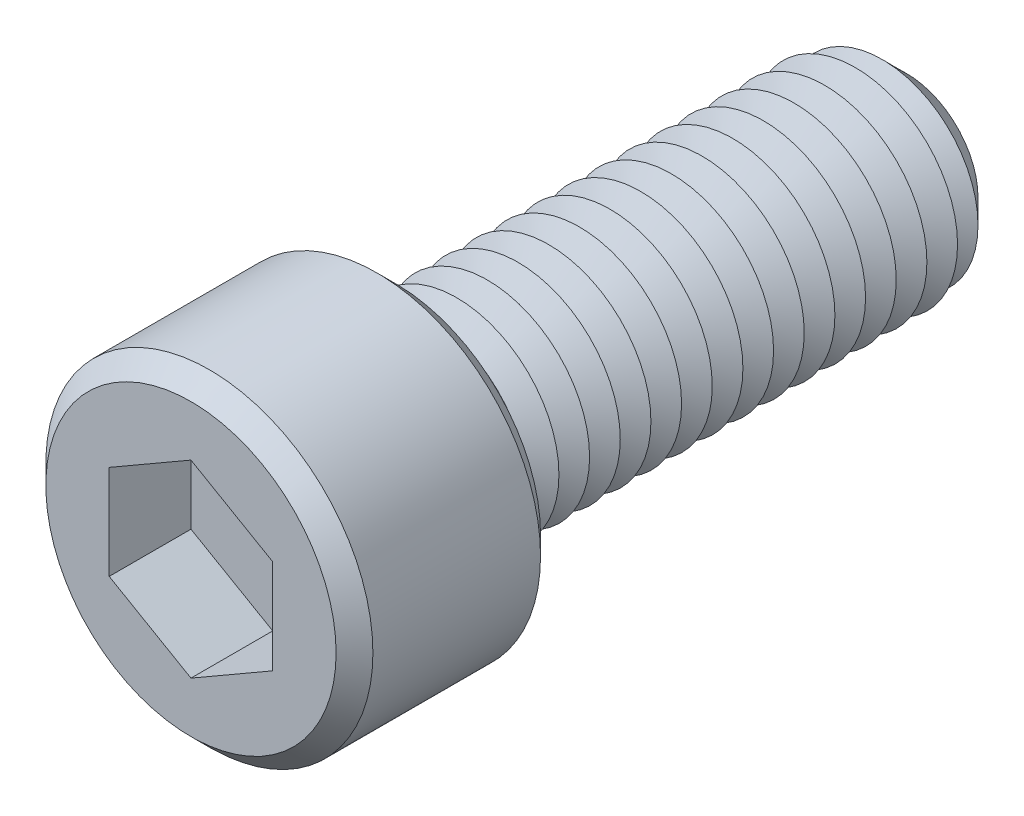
from build123d import *

# Parameters (mm, degrees)
SKETCH1_R           = 8
BOSS_EXTRUDE1_DEPTH = 10
SKETCH2_R           = 5
BOSS_EXTRUDE2_DEPTH = 25
CHAMFER1_SIZE       = 1.5
LPATTERN1_COUNT     = 16
LPATTERN1_PITCH     = 1.5
CUT_EXTRUDE1_DEPTH  = 4
SKETCH6_R           = 0.9
CUT_EXTRUDE2_DEPTH  = 31
CHAMFER2_SIZE       = 0.9


with BuildPart() as part:
    # Sketch1 → Boss-Extrude1 (new body)
    with BuildSketch(Plane.XY):
        Circle(SKETCH1_R)
    extrude(amount=BOSS_EXTRUDE1_DEPTH)

    # Sketch2 → Boss-Extrude2 (add)
    with BuildSketch(Plane(origin=(0, 0, 0), x_dir=(-1, 0, 0), z_dir=(0, 0, -1))):
        Circle(SKETCH2_R)
    extrude(amount=BOSS_EXTRUDE2_DEPTH)

    # Chamfer1
    chamfer1_edges = [part.edges().sort_by_distance(p)[0] for p in [
        (5, 0, -25),
    ]]
    chamfer(chamfer1_edges, length=CHAMFER1_SIZE)

    # Sketch4 → Cut-Revolve1 (revolve, cut)
    with BuildSketch(Plane(origin=(0, 0, 0), x_dir=(0, 0, -1), z_dir=(1, 0, 0)), mode=Mode.PRIVATE) as cut_revolve1_sk:
        Polygon((0, 5), (0.75, 3.700961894), (1.5, 5), align=None)
    cut_revolve1 = revolve(cut_revolve1_sk.sketch.rotate(Axis((0, 0, 2.512122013), (0, 0, -1)), 90), axis=Axis((0, 0, 2.512122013), (0, 0, -1)), mode=Mode.SUBTRACT)

    # LPattern1: Cut-Revolve1 ×16
    with Locations(*[(0, 0, -i * LPATTERN1_PITCH) for i in range(1, LPATTERN1_COUNT)]):
        add(cut_revolve1, mode=Mode.SUBTRACT)

    # Sketch5 → Cut-Extrude1 (cut)
    with BuildSketch(Plane.XY.offset(10)):
        Polygon((0, 4.618802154), (-4, 2.309401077), (-4, -2.309401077), (0, -4.618802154), (4, -2.309401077), (4, 2.309401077), align=None)
    extrude(amount=-CUT_EXTRUDE1_DEPTH, mode=Mode.SUBTRACT)

    # Sketch6 → Cut-Extrude2 (cut)
    with BuildSketch(Plane.XY.offset(6)):
        Circle(SKETCH6_R)
    extrude(amount=-CUT_EXTRUDE2_DEPTH, mode=Mode.SUBTRACT)

    # Chamfer2
    chamfer2_edges = [part.edges().sort_by_distance(p)[0] for p in [
        (-8, 0, 0),
        (-8, 0, 10),
    ]]
    chamfer(chamfer2_edges, length=CHAMFER2_SIZE)


solid = part.part
